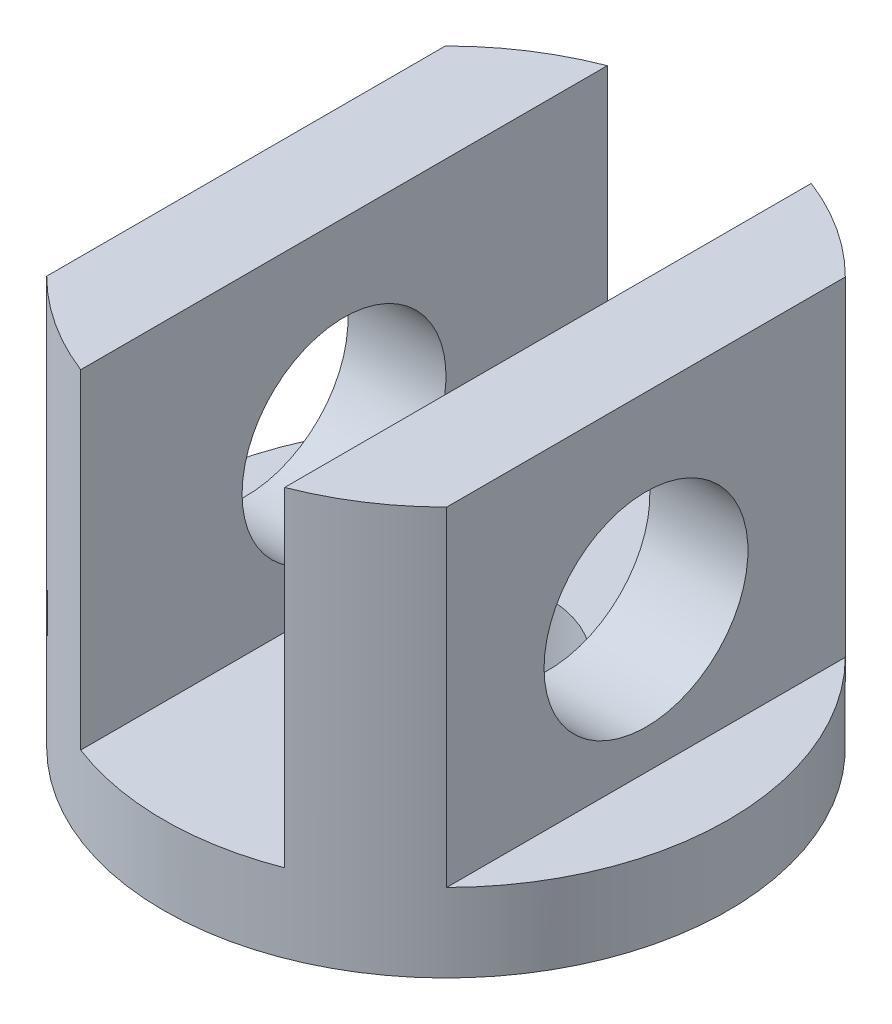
from build123d import *

# Parameters (mm, degrees)
SKETCH_1_R               = 72
EXTRUDE_1_DEPTH          = 20
EXTRUDE_2_DEPTH          = 51
EXTRUDE_2_DEPTH_BACK     = 51
SKETCH_2_W               = 150
SKETCH_2_H               = 84
CUT_EXTRUDE_1_DEPTH      = 148.054411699
CUT_EXTRUDE_1_DEPTH_BACK = 148.054411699
SKETCH_3_W               = 52
SKETCH_3_H               = 84
SKETCH_4_R               = 26
CUT_EXTRUDE_2_DEPTH      = 178.679486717
SKETCH_5_R               = 26
CUT_EXTRUDE_3_DEPTH      = 134.66001646
CUT_EXTRUDE_6_DEPTH      = 148.054411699
CUT_EXTRUDE_6_DEPTH_BACK = 10
SKETCH_6_OUTSIDE_W       = 192.498
SKETCH_6_OUTSIDE_H       = 198.498
SKETCH_6_OUTSIDE_R       = 72


with BuildPart() as part:
    # Sketch 1 → Extrude 1 (new body)
    with BuildSketch(Plane(origin=(0, 0, 0), x_dir=(1, 0, 0), z_dir=(0, 1, 0))):
        with Locations(Location((0, 0, 0), (0, 0, 270))):
            Circle(SKETCH_1_R)
    extrude(amount=EXTRUDE_1_DEPTH)

    # Sketch 2 → Extrude 2 (add, two sides: drawn at the far end of the back side and taken through both)
    with BuildSketch(Plane(origin=(0, 0, 0), x_dir=(0, 0, -1), z_dir=(1, 0, 0)).offset(-EXTRUDE_2_DEPTH_BACK)):
        with Locations((0, 62)):
            Rectangle(SKETCH_2_W, SKETCH_2_H)
    extrude(amount=EXTRUDE_2_DEPTH + EXTRUDE_2_DEPTH_BACK)

    # Sketch 3 → Cut-Extrude 1 (cut, two sides: drawn at the far end of the back side and taken through both)
    with BuildSketch(Plane.XY.offset(-CUT_EXTRUDE_1_DEPTH_BACK)):
        with Locations((0, 62)):
            Rectangle(SKETCH_3_W, SKETCH_3_H)
    extrude(amount=CUT_EXTRUDE_1_DEPTH + CUT_EXTRUDE_1_DEPTH_BACK, mode=Mode.SUBTRACT)

    # Sketch 4 → Cut-Extrude 2 (cut, through all)
    with BuildSketch(Plane.ZY.offset(51)):
        with Locations((0, 56)):
            Circle(SKETCH_4_R)
    extrude(amount=-CUT_EXTRUDE_2_DEPTH, mode=Mode.SUBTRACT)

    # Sketch 5 → Cut-Extrude 3 (cut, through all)
    with BuildSketch(Plane(origin=(0, 20, 0), x_dir=(1, 0, 0), z_dir=(0, 1, 0))):
        with Locations(Location((0, 0, 0), (0, 0, 270))):
            Circle(SKETCH_5_R)
    extrude(amount=-CUT_EXTRUDE_3_DEPTH, mode=Mode.SUBTRACT)

    # Sketch 6 outside → Cut-Extrude 6 (cut, two sides: drawn at the far end of the back side and taken through both)
    with BuildSketch(Plane(origin=(0, 0, 0), x_dir=(1, 0, 0), z_dir=(0, 1, 0)).offset(-CUT_EXTRUDE_6_DEPTH_BACK)):
        Rectangle(SKETCH_6_OUTSIDE_W, SKETCH_6_OUTSIDE_H)
        with Locations(Location((0, 0, 0), (0, 0, 111.168448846))):
            Circle(SKETCH_6_OUTSIDE_R, mode=Mode.SUBTRACT)
    extrude(amount=CUT_EXTRUDE_6_DEPTH + CUT_EXTRUDE_6_DEPTH_BACK, mode=Mode.SUBTRACT)


solid = part.part
